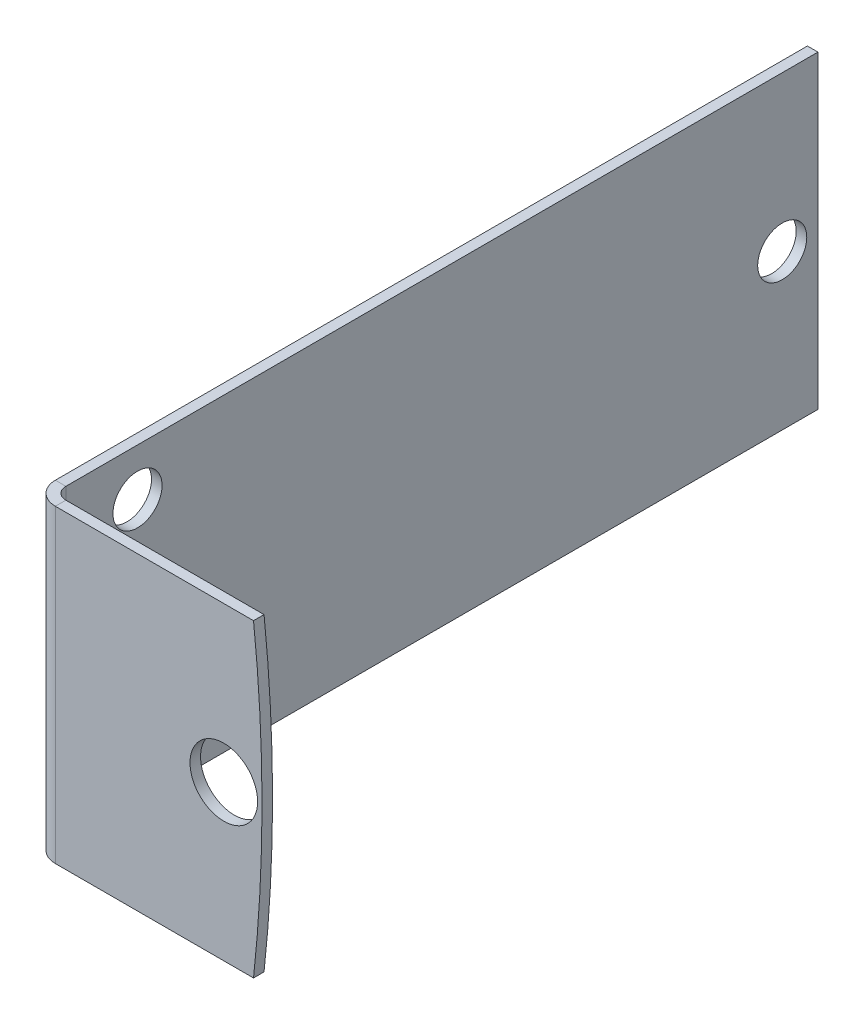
ISO-10303-21;
HEADER;
FILE_DESCRIPTION(('STEP AP214'),'2;1');
FILE_NAME('part.step','',(''),(''),'','','');
FILE_SCHEMA(('AUTOMOTIVE_DESIGN { 1 0 10303 214 1 1 1 1 }'));
ENDSEC;
DATA;
#1=APPLICATION_CONTEXT('core data for automotive mechanical design processes');
#2=APPLICATION_PROTOCOL_DEFINITION('international standard','automotive_design',2000,#1);
#3=PRODUCT_CONTEXT('',#1,'mechanical');
#4=PRODUCT('Part','Part','',(#3));
#5=PRODUCT_RELATED_PRODUCT_CATEGORY('part','',(#4));
#6=PRODUCT_DEFINITION_FORMATION('','',#4);
#7=PRODUCT_DEFINITION_CONTEXT('part definition',#1,'design');
#8=PRODUCT_DEFINITION('design','',#6,#7);
#9=PRODUCT_DEFINITION_SHAPE('','',#8);
#10=(LENGTH_UNIT() NAMED_UNIT(*) SI_UNIT(.MILLI.,.METRE.));
#11=(NAMED_UNIT(*) PLANE_ANGLE_UNIT() SI_UNIT($,.RADIAN.));
#12=(NAMED_UNIT(*) SI_UNIT($,.STERADIAN.) SOLID_ANGLE_UNIT());
#13=UNCERTAINTY_MEASURE_WITH_UNIT(LENGTH_MEASURE(1.E-05),#10,'distance_accuracy_value','');
#14=(GEOMETRIC_REPRESENTATION_CONTEXT(3) GLOBAL_UNCERTAINTY_ASSIGNED_CONTEXT((#13)) GLOBAL_UNIT_ASSIGNED_CONTEXT((#10,
#11,#12)) REPRESENTATION_CONTEXT('',''));
#15=CARTESIAN_POINT('',(0.,0.,0.));
#16=DIRECTION('',(0.,0.,1.));
#17=DIRECTION('',(1.,0.,0.));
#18=AXIS2_PLACEMENT_3D('',#15,#16,#17);
#19=CARTESIAN_POINT('',(-78.74,10.287,0.700000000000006));
#20=DIRECTION('',(0.,0.,-1.));
#21=DIRECTION('',(-1.,0.,0.));
#22=AXIS2_PLACEMENT_3D('',#19,#20,#21);
#23=PLANE('',#22);
#24=CARTESIAN_POINT('',(12.7,10.287,0.7000000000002));
#25=DIRECTION('',(0.,0.,1.));
#26=DIRECTION('',(1.,0.,0.));
#27=AXIS2_PLACEMENT_3D('',#24,#25,#26);
#28=CIRCLE('',#27,2.2479);
#29=CARTESIAN_POINT('',(14.9479,10.287,0.7000000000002));
#30=VERTEX_POINT('',#29);
#31=EDGE_CURVE('E183',#30,#30,#28,.T.);
#32=ORIENTED_EDGE('',*,*,#31,.F.);
#33=EDGE_LOOP('',(#32));
#34=FACE_BOUND('',#33,.T.);
#35=DIRECTION('',(0.,1.,0.));
#36=VECTOR('',#35,1.);
#37=CARTESIAN_POINT('',(1.5,20.574,0.700000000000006));
#38=LINE('',#37,#36);
#39=CARTESIAN_POINT('',(1.5,20.574,0.700000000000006));
#40=VERTEX_POINT('',#39);
#41=CARTESIAN_POINT('',(1.5,0.,0.700000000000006));
#42=VERTEX_POINT('',#41);
#43=EDGE_CURVE('E69',#40,#42,#38,.F.);
#44=ORIENTED_EDGE('',*,*,#43,.T.);
#45=DIRECTION('',(1.,0.,0.));
#46=VECTOR('',#45,1.);
#47=CARTESIAN_POINT('',(0.,0.,0.700000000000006));
#48=LINE('',#47,#46);
#49=CARTESIAN_POINT('',(14.6752986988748,0.,0.700000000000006));
#50=VERTEX_POINT('',#49);
#51=EDGE_CURVE('E189',#42,#50,#48,.T.);
#52=ORIENTED_EDGE('',*,*,#51,.T.);
#53=CARTESIAN_POINT('',(-78.74,10.287,0.700000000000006));
#54=DIRECTION('',(0.,0.,1.));
#55=DIRECTION('',(-1.,0.,0.));
#56=AXIS2_PLACEMENT_3D('',#53,#54,#55);
#57=CIRCLE('',#56,93.98);
#58=CARTESIAN_POINT('',(14.6752986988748,20.574,0.700000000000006));
#59=VERTEX_POINT('',#58);
#60=EDGE_CURVE('E191',#50,#59,#57,.T.);
#61=ORIENTED_EDGE('',*,*,#60,.T.);
#62=DIRECTION('',(-1.,0.,0.));
#63=VECTOR('',#62,1.);
#64=CARTESIAN_POINT('',(0.,20.574,0.700000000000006));
#65=LINE('',#64,#63);
#66=EDGE_CURVE('E194',#59,#40,#65,.T.);
#67=ORIENTED_EDGE('',*,*,#66,.T.);
#68=EDGE_LOOP('',(#44,#52,#61,#67));
#69=FACE_BOUND('',#68,.T.);
#70=ADVANCED_FACE('F52',(#34,#69),#23,.F.);
#71=CARTESIAN_POINT('',(-78.74,10.287,0.));
#72=DIRECTION('',(0.,0.,-1.));
#73=DIRECTION('',(-1.,0.,0.));
#74=AXIS2_PLACEMENT_3D('',#71,#72,#73);
#75=PLANE('',#74);
#76=CARTESIAN_POINT('',(12.7,10.287,2.22044604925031E-13));
#77=DIRECTION('',(0.,0.,1.));
#78=DIRECTION('',(1.,0.,0.));
#79=AXIS2_PLACEMENT_3D('',#76,#77,#78);
#80=CIRCLE('',#79,2.2479);
#81=CARTESIAN_POINT('',(14.9479,10.287,2.22044604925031E-13));
#82=VERTEX_POINT('',#81);
#83=EDGE_CURVE('E180',#82,#82,#80,.T.);
#84=ORIENTED_EDGE('',*,*,#83,.T.);
#85=EDGE_LOOP('',(#84));
#86=FACE_BOUND('',#85,.T.);
#87=DIRECTION('',(1.,0.,0.));
#88=VECTOR('',#87,1.);
#89=CARTESIAN_POINT('',(0.,0.,0.));
#90=LINE('',#89,#88);
#91=CARTESIAN_POINT('',(1.5,0.,0.));
#92=VERTEX_POINT('',#91);
#93=CARTESIAN_POINT('',(14.6752986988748,0.,0.));
#94=VERTEX_POINT('',#93);
#95=EDGE_CURVE('E186',#92,#94,#90,.T.);
#96=ORIENTED_EDGE('',*,*,#95,.F.);
#97=DIRECTION('',(0.,1.,0.));
#98=VECTOR('',#97,1.);
#99=CARTESIAN_POINT('',(1.5,20.574,0.));
#100=LINE('',#99,#98);
#101=CARTESIAN_POINT('',(1.5,20.574,0.));
#102=VERTEX_POINT('',#101);
#103=EDGE_CURVE('E173',#102,#92,#100,.F.);
#104=ORIENTED_EDGE('',*,*,#103,.F.);
#105=DIRECTION('',(-1.,0.,0.));
#106=VECTOR('',#105,1.);
#107=CARTESIAN_POINT('',(0.,20.574,0.));
#108=LINE('',#107,#106);
#109=CARTESIAN_POINT('',(14.6752986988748,20.574,0.));
#110=VERTEX_POINT('',#109);
#111=EDGE_CURVE('E192',#110,#102,#108,.T.);
#112=ORIENTED_EDGE('',*,*,#111,.F.);
#113=CARTESIAN_POINT('',(-78.74,10.287,0.));
#114=DIRECTION('',(0.,0.,1.));
#115=DIRECTION('',(-1.,0.,0.));
#116=AXIS2_PLACEMENT_3D('',#113,#114,#115);
#117=CIRCLE('',#116,93.98);
#118=EDGE_CURVE('E197',#94,#110,#117,.T.);
#119=ORIENTED_EDGE('',*,*,#118,.F.);
#120=EDGE_LOOP('',(#96,#104,#112,#119));
#121=FACE_BOUND('',#120,.T.);
#122=ADVANCED_FACE('F257',(#86,#121),#75,.T.);
#123=CARTESIAN_POINT('',(0.,0.,0.700000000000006));
#124=DIRECTION('',(0.,1.,0.));
#125=DIRECTION('',(0.,0.,1.));
#126=AXIS2_PLACEMENT_3D('',#123,#124,#125);
#127=PLANE('',#126);
#128=DIRECTION('',(0.,0.,1.));
#129=VECTOR('',#128,1.);
#130=CARTESIAN_POINT('',(1.5,0.,0.));
#131=LINE('',#130,#129);
#132=EDGE_CURVE('E76',#92,#42,#131,.T.);
#133=ORIENTED_EDGE('',*,*,#132,.F.);
#134=ORIENTED_EDGE('',*,*,#95,.T.);
#135=DIRECTION('',(0.,0.,-1.));
#136=VECTOR('',#135,1.);
#137=CARTESIAN_POINT('',(14.6752986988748,0.,0.700000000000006));
#138=LINE('',#137,#136);
#139=EDGE_CURVE('E13',#50,#94,#138,.T.);
#140=ORIENTED_EDGE('',*,*,#139,.F.);
#141=ORIENTED_EDGE('',*,*,#51,.F.);
#142=EDGE_LOOP('',(#133,#134,#140,#141));
#143=FACE_BOUND('',#142,.T.);
#144=ADVANCED_FACE('F54',(#143),#127,.F.);
#145=CARTESIAN_POINT('',(0.,20.574,0.700000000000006));
#146=DIRECTION('',(0.,-1.,0.));
#147=DIRECTION('',(1.,0.,0.));
#148=AXIS2_PLACEMENT_3D('',#145,#146,#147);
#149=PLANE('',#148);
#150=DIRECTION('',(0.,0.,1.));
#151=VECTOR('',#150,1.);
#152=CARTESIAN_POINT('',(1.5,20.574,0.));
#153=LINE('',#152,#151);
#154=EDGE_CURVE('E167',#102,#40,#153,.T.);
#155=ORIENTED_EDGE('',*,*,#154,.T.);
#156=ORIENTED_EDGE('',*,*,#66,.F.);
#157=DIRECTION('',(0.,0.,-1.));
#158=VECTOR('',#157,1.);
#159=CARTESIAN_POINT('',(14.6752986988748,20.574,0.700000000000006));
#160=LINE('',#159,#158);
#161=EDGE_CURVE('E61',#59,#110,#160,.T.);
#162=ORIENTED_EDGE('',*,*,#161,.T.);
#163=ORIENTED_EDGE('',*,*,#111,.T.);
#164=EDGE_LOOP('',(#155,#156,#162,#163));
#165=FACE_BOUND('',#164,.T.);
#166=ADVANCED_FACE('F234',(#165),#149,.F.);
#167=CARTESIAN_POINT('',(-78.74,10.287,0.700000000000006));
#168=DIRECTION('',(0.,0.,-1.));
#169=DIRECTION('',(-1.,0.,0.));
#170=AXIS2_PLACEMENT_3D('',#167,#168,#169);
#171=CYLINDRICAL_SURFACE('',#170,93.98);
#172=ORIENTED_EDGE('',*,*,#118,.T.);
#173=ORIENTED_EDGE('',*,*,#161,.F.);
#174=ORIENTED_EDGE('',*,*,#60,.F.);
#175=ORIENTED_EDGE('',*,*,#139,.T.);
#176=EDGE_LOOP('',(#172,#173,#174,#175));
#177=FACE_BOUND('',#176,.T.);
#178=ADVANCED_FACE('F250',(#177),#171,.T.);
#179=CARTESIAN_POINT('',(12.7,10.287,0.7000000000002));
#180=DIRECTION('',(0.,0.,-1.));
#181=DIRECTION('',(-1.,0.,0.));
#182=AXIS2_PLACEMENT_3D('',#179,#180,#181);
#183=CYLINDRICAL_SURFACE('',#182,2.2479);
#184=ORIENTED_EDGE('',*,*,#31,.T.);
#185=EDGE_LOOP('',(#184));
#186=FACE_BOUND('',#185,.T.);
#187=ORIENTED_EDGE('',*,*,#83,.F.);
#188=EDGE_LOOP('',(#187));
#189=FACE_BOUND('',#188,.T.);
#190=ADVANCED_FACE('F243',(#186,#189),#183,.F.);
#191=CARTESIAN_POINT('',(1.5,0.,-0.799999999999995));
#192=DIRECTION('',(0.,-1.,0.));
#193=DIRECTION('',(1.,0.,0.));
#194=AXIS2_PLACEMENT_3D('',#191,#192,#193);
#195=PLANE('',#194);
#196=DIRECTION('',(1.,0.,0.));
#197=VECTOR('',#196,1.);
#198=CARTESIAN_POINT('',(0.,0.,-0.799999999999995));
#199=LINE('',#198,#197);
#200=CARTESIAN_POINT('',(0.699999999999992,0.,-0.799999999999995));
#201=VERTEX_POINT('',#200);
#202=CARTESIAN_POINT('',(0.,0.,-0.799999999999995));
#203=VERTEX_POINT('',#202);
#204=EDGE_CURVE('E143',#201,#203,#199,.F.);
#205=ORIENTED_EDGE('',*,*,#204,.F.);
#206=CARTESIAN_POINT('',(1.5,0.,-0.799999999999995));
#207=DIRECTION('',(0.,1.,0.));
#208=DIRECTION('',(-1.,0.,0.));
#209=AXIS2_PLACEMENT_3D('',#206,#207,#208);
#210=CIRCLE('',#209,0.800000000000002);
#211=EDGE_CURVE('E170',#92,#201,#210,.F.);
#212=ORIENTED_EDGE('',*,*,#211,.F.);
#213=ORIENTED_EDGE('',*,*,#132,.T.);
#214=CARTESIAN_POINT('',(1.5,0.,-0.799999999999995));
#215=DIRECTION('',(0.,1.,0.));
#216=DIRECTION('',(-1.,0.,0.));
#217=AXIS2_PLACEMENT_3D('',#214,#215,#216);
#218=CIRCLE('',#217,1.5);
#219=EDGE_CURVE('E163',#42,#203,#218,.F.);
#220=ORIENTED_EDGE('',*,*,#219,.T.);
#221=EDGE_LOOP('',(#205,#212,#213,#220));
#222=FACE_BOUND('',#221,.T.);
#223=ADVANCED_FACE('F241',(#222),#195,.T.);
#224=CARTESIAN_POINT('',(1.49999999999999,20.574,-0.799999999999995));
#225=DIRECTION('',(0.,-1.,0.));
#226=DIRECTION('',(1.,0.,0.));
#227=AXIS2_PLACEMENT_3D('',#224,#225,#226);
#228=PLANE('',#227);
#229=CARTESIAN_POINT('',(1.49999999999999,20.574,-0.799999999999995));
#230=DIRECTION('',(0.,1.,0.));
#231=DIRECTION('',(-1.,0.,0.));
#232=AXIS2_PLACEMENT_3D('',#229,#230,#231);
#233=CIRCLE('',#232,0.800000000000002);
#234=CARTESIAN_POINT('',(0.699999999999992,20.574,-0.799999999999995));
#235=VERTEX_POINT('',#234);
#236=EDGE_CURVE('E176',#235,#102,#233,.T.);
#237=ORIENTED_EDGE('',*,*,#236,.F.);
#238=DIRECTION('',(1.,0.,0.));
#239=VECTOR('',#238,1.);
#240=CARTESIAN_POINT('',(0.699999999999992,20.574,-0.799999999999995));
#241=LINE('',#240,#239);
#242=CARTESIAN_POINT('',(0.,20.574,-0.799999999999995));
#243=VERTEX_POINT('',#242);
#244=EDGE_CURVE('E155',#235,#243,#241,.F.);
#245=ORIENTED_EDGE('',*,*,#244,.T.);
#246=CARTESIAN_POINT('',(1.49999999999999,20.574,-0.799999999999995));
#247=DIRECTION('',(0.,1.,0.));
#248=DIRECTION('',(-1.,0.,0.));
#249=AXIS2_PLACEMENT_3D('',#246,#247,#248);
#250=CIRCLE('',#249,1.5);
#251=EDGE_CURVE('E164',#243,#40,#250,.T.);
#252=ORIENTED_EDGE('',*,*,#251,.T.);
#253=ORIENTED_EDGE('',*,*,#154,.F.);
#254=EDGE_LOOP('',(#237,#245,#252,#253));
#255=FACE_BOUND('',#254,.T.);
#256=ADVANCED_FACE('F231',(#255),#228,.F.);
#257=CARTESIAN_POINT('',(1.49999999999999,20.574,-0.799999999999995));
#258=DIRECTION('',(0.,1.,0.));
#259=DIRECTION('',(-1.,0.,0.));
#260=AXIS2_PLACEMENT_3D('',#257,#258,#259);
#261=CYLINDRICAL_SURFACE('',#260,1.5);
#262=ORIENTED_EDGE('',*,*,#43,.F.);
#263=ORIENTED_EDGE('',*,*,#251,.F.);
#264=DIRECTION('',(0.,1.,0.));
#265=VECTOR('',#264,1.);
#266=CARTESIAN_POINT('',(0.,0.,-0.799999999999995));
#267=LINE('',#266,#265);
#268=EDGE_CURVE('E153',#243,#203,#267,.F.);
#269=ORIENTED_EDGE('',*,*,#268,.T.);
#270=ORIENTED_EDGE('',*,*,#219,.F.);
#271=EDGE_LOOP('',(#262,#263,#269,#270));
#272=FACE_BOUND('',#271,.T.);
#273=ADVANCED_FACE('F239',(#272),#261,.T.);
#274=CARTESIAN_POINT('',(1.49999999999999,20.574,-0.799999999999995));
#275=DIRECTION('',(0.,1.,0.));
#276=DIRECTION('',(-1.,0.,0.));
#277=AXIS2_PLACEMENT_3D('',#274,#275,#276);
#278=CYLINDRICAL_SURFACE('',#277,0.800000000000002);
#279=ORIENTED_EDGE('',*,*,#103,.T.);
#280=ORIENTED_EDGE('',*,*,#211,.T.);
#281=DIRECTION('',(0.,1.,0.));
#282=VECTOR('',#281,1.);
#283=CARTESIAN_POINT('',(0.699999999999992,0.,-0.799999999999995));
#284=LINE('',#283,#282);
#285=EDGE_CURVE('E158',#201,#235,#284,.T.);
#286=ORIENTED_EDGE('',*,*,#285,.T.);
#287=ORIENTED_EDGE('',*,*,#236,.T.);
#288=EDGE_LOOP('',(#279,#280,#286,#287));
#289=FACE_BOUND('',#288,.T.);
#290=ADVANCED_FACE('F227',(#289),#278,.F.);
#291=CARTESIAN_POINT('',(-1.80411241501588E-13,20.574,-50.8));
#292=DIRECTION('',(0.,-1.,0.));
#293=DIRECTION('',(1.,0.,0.));
#294=AXIS2_PLACEMENT_3D('',#291,#292,#293);
#295=PLANE('',#294);
#296=ORIENTED_EDGE('',*,*,#244,.F.);
#297=DIRECTION('',(0.,0.,1.));
#298=VECTOR('',#297,1.);
#299=CARTESIAN_POINT('',(0.699999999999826,20.574,-50.8));
#300=LINE('',#299,#298);
#301=CARTESIAN_POINT('',(0.699999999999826,20.574,-50.8));
#302=VERTEX_POINT('',#301);
#303=EDGE_CURVE('E151',#235,#302,#300,.F.);
#304=ORIENTED_EDGE('',*,*,#303,.T.);
#305=DIRECTION('',(1.,0.,0.));
#306=VECTOR('',#305,1.);
#307=CARTESIAN_POINT('',(-1.80411241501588E-13,20.574,-50.8));
#308=LINE('',#307,#306);
#309=CARTESIAN_POINT('',(-1.80411241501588E-13,20.574,-50.8));
#310=VERTEX_POINT('',#309);
#311=EDGE_CURVE('E139',#310,#302,#308,.T.);
#312=ORIENTED_EDGE('',*,*,#311,.F.);
#313=DIRECTION('',(0.,0.,-1.));
#314=VECTOR('',#313,1.);
#315=CARTESIAN_POINT('',(0.,20.574,0.));
#316=LINE('',#315,#314);
#317=EDGE_CURVE('E126',#243,#310,#316,.T.);
#318=ORIENTED_EDGE('',*,*,#317,.F.);
#319=EDGE_LOOP('',(#296,#304,#312,#318));
#320=FACE_BOUND('',#319,.T.);
#321=ADVANCED_FACE('F220',(#320),#295,.F.);
#322=CARTESIAN_POINT('',(0.,0.,0.));
#323=DIRECTION('',(0.,1.,0.));
#324=DIRECTION('',(-1.,0.,0.));
#325=AXIS2_PLACEMENT_3D('',#322,#323,#324);
#326=PLANE('',#325);
#327=ORIENTED_EDGE('',*,*,#204,.T.);
#328=DIRECTION('',(0.,0.,1.));
#329=VECTOR('',#328,1.);
#330=CARTESIAN_POINT('',(0.,0.,0.));
#331=LINE('',#330,#329);
#332=CARTESIAN_POINT('',(-1.80411241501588E-13,0.,-50.8));
#333=VERTEX_POINT('',#332);
#334=EDGE_CURVE('E124',#333,#203,#331,.T.);
#335=ORIENTED_EDGE('',*,*,#334,.F.);
#336=DIRECTION('',(1.,0.,0.));
#337=VECTOR('',#336,1.);
#338=CARTESIAN_POINT('',(-1.80411241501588E-13,0.,-50.8));
#339=LINE('',#338,#337);
#340=CARTESIAN_POINT('',(0.699999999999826,0.,-50.8));
#341=VERTEX_POINT('',#340);
#342=EDGE_CURVE('E132',#333,#341,#339,.T.);
#343=ORIENTED_EDGE('',*,*,#342,.T.);
#344=DIRECTION('',(0.,0.,-1.));
#345=VECTOR('',#344,1.);
#346=CARTESIAN_POINT('',(0.700000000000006,0.,0.));
#347=LINE('',#346,#345);
#348=EDGE_CURVE('E148',#341,#201,#347,.F.);
#349=ORIENTED_EDGE('',*,*,#348,.T.);
#350=EDGE_LOOP('',(#327,#335,#343,#349));
#351=FACE_BOUND('',#350,.T.);
#352=ADVANCED_FACE('F142',(#351),#326,.F.);
#353=CARTESIAN_POINT('',(0.,20.574,0.));
#354=DIRECTION('',(1.,0.,0.));
#355=DIRECTION('',(0.,0.,-1.));
#356=AXIS2_PLACEMENT_3D('',#353,#354,#355);
#357=PLANE('',#356);
#358=CARTESIAN_POINT('',(-1.66533453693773E-13,10.287,-48.425));
#359=DIRECTION('',(-1.,0.,0.));
#360=DIRECTION('',(0.,0.,1.));
#361=AXIS2_PLACEMENT_3D('',#358,#359,#360);
#362=CIRCLE('',#361,1.63194999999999);
#363=CARTESIAN_POINT('',(-1.60835527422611E-13,10.287,-46.79305));
#364=VERTEX_POINT('',#363);
#365=EDGE_CURVE('E216',#364,#364,#362,.T.);
#366=ORIENTED_EDGE('',*,*,#365,.F.);
#367=EDGE_LOOP('',(#366));
#368=FACE_BOUND('',#367,.T.);
#369=CARTESIAN_POINT('',(-1.38777878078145E-13,17.43075,-5.5625));
#370=DIRECTION('',(-1.,0.,0.));
#371=DIRECTION('',(0.,0.,1.));
#372=AXIS2_PLACEMENT_3D('',#369,#370,#371);
#373=CIRCLE('',#372,1.63194999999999);
#374=CARTESIAN_POINT('',(-1.33079951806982E-13,17.43075,-3.93055000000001));
#375=VERTEX_POINT('',#374);
#376=EDGE_CURVE('E206',#375,#375,#373,.T.);
#377=ORIENTED_EDGE('',*,*,#376,.F.);
#378=EDGE_LOOP('',(#377));
#379=FACE_BOUND('',#378,.T.);
#380=CARTESIAN_POINT('',(-1.38777878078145E-13,3.14325,-5.5625));
#381=DIRECTION('',(-1.,0.,0.));
#382=DIRECTION('',(0.,0.,1.));
#383=AXIS2_PLACEMENT_3D('',#380,#381,#382);
#384=CIRCLE('',#383,1.63194999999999);
#385=CARTESIAN_POINT('',(-1.33079951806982E-13,3.14325,-3.93055000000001));
#386=VERTEX_POINT('',#385);
#387=EDGE_CURVE('E203',#386,#386,#384,.T.);
#388=ORIENTED_EDGE('',*,*,#387,.F.);
#389=EDGE_LOOP('',(#388));
#390=FACE_BOUND('',#389,.T.);
#391=ORIENTED_EDGE('',*,*,#268,.F.);
#392=ORIENTED_EDGE('',*,*,#317,.T.);
#393=DIRECTION('',(0.,-1.,0.));
#394=VECTOR('',#393,1.);
#395=CARTESIAN_POINT('',(-1.80411241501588E-13,20.574,-50.8));
#396=LINE('',#395,#394);
#397=EDGE_CURVE('E119',#310,#333,#396,.T.);
#398=ORIENTED_EDGE('',*,*,#397,.T.);
#399=ORIENTED_EDGE('',*,*,#334,.T.);
#400=EDGE_LOOP('',(#391,#392,#398,#399));
#401=FACE_BOUND('',#400,.T.);
#402=ADVANCED_FACE('F122',(#368,#379,#390,#401),#357,.F.);
#403=CARTESIAN_POINT('',(0.699999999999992,20.574,0.));
#404=DIRECTION('',(1.,0.,0.));
#405=DIRECTION('',(0.,0.,-1.));
#406=AXIS2_PLACEMENT_3D('',#403,#404,#405);
#407=PLANE('',#406);
#408=CARTESIAN_POINT('',(0.699999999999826,10.287,-48.425));
#409=DIRECTION('',(1.,0.,0.));
#410=DIRECTION('',(0.,0.,-1.));
#411=AXIS2_PLACEMENT_3D('',#408,#409,#410);
#412=CIRCLE('',#411,1.63194999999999);
#413=CARTESIAN_POINT('',(0.69999999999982,10.287,-50.05695));
#414=VERTEX_POINT('',#413);
#415=EDGE_CURVE('E56',#414,#414,#412,.T.);
#416=ORIENTED_EDGE('',*,*,#415,.F.);
#417=EDGE_LOOP('',(#416));
#418=FACE_BOUND('',#417,.T.);
#419=CARTESIAN_POINT('',(0.699999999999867,17.43075,-5.5625));
#420=DIRECTION('',(1.,0.,0.));
#421=DIRECTION('',(0.,0.,-1.));
#422=AXIS2_PLACEMENT_3D('',#419,#420,#421);
#423=CIRCLE('',#422,1.63194999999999);
#424=CARTESIAN_POINT('',(0.699999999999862,17.43075,-7.19444999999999));
#425=VERTEX_POINT('',#424);
#426=EDGE_CURVE('E204',#425,#425,#423,.T.);
#427=ORIENTED_EDGE('',*,*,#426,.F.);
#428=EDGE_LOOP('',(#427));
#429=FACE_BOUND('',#428,.T.);
#430=CARTESIAN_POINT('',(0.699999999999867,3.14325,-5.5625));
#431=DIRECTION('',(1.,0.,0.));
#432=DIRECTION('',(0.,0.,-1.));
#433=AXIS2_PLACEMENT_3D('',#430,#431,#432);
#434=CIRCLE('',#433,1.63194999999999);
#435=CARTESIAN_POINT('',(0.699999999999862,3.14325,-7.19444999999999));
#436=VERTEX_POINT('',#435);
#437=EDGE_CURVE('E161',#436,#436,#434,.T.);
#438=ORIENTED_EDGE('',*,*,#437,.F.);
#439=EDGE_LOOP('',(#438));
#440=FACE_BOUND('',#439,.T.);
#441=ORIENTED_EDGE('',*,*,#303,.F.);
#442=ORIENTED_EDGE('',*,*,#285,.F.);
#443=ORIENTED_EDGE('',*,*,#348,.F.);
#444=DIRECTION('',(0.,1.,0.));
#445=VECTOR('',#444,1.);
#446=CARTESIAN_POINT('',(0.699999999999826,0.,-50.8));
#447=LINE('',#446,#445);
#448=EDGE_CURVE('E135',#302,#341,#447,.F.);
#449=ORIENTED_EDGE('',*,*,#448,.F.);
#450=EDGE_LOOP('',(#441,#442,#443,#449));
#451=FACE_BOUND('',#450,.T.);
#452=ADVANCED_FACE('F224',(#418,#429,#440,#451),#407,.T.);
#453=CARTESIAN_POINT('',(-1.80411241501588E-13,0.,-50.8));
#454=DIRECTION('',(0.,0.,1.));
#455=DIRECTION('',(1.,0.,0.));
#456=AXIS2_PLACEMENT_3D('',#453,#454,#455);
#457=PLANE('',#456);
#458=ORIENTED_EDGE('',*,*,#448,.T.);
#459=ORIENTED_EDGE('',*,*,#342,.F.);
#460=ORIENTED_EDGE('',*,*,#397,.F.);
#461=ORIENTED_EDGE('',*,*,#311,.T.);
#462=EDGE_LOOP('',(#458,#459,#460,#461));
#463=FACE_BOUND('',#462,.T.);
#464=ADVANCED_FACE('F133',(#463),#457,.F.);
#465=CARTESIAN_POINT('',(-1.2490009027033E-13,3.14325,-5.5625));
#466=DIRECTION('',(-1.,0.,0.));
#467=DIRECTION('',(0.,0.,1.));
#468=AXIS2_PLACEMENT_3D('',#465,#466,#467);
#469=CYLINDRICAL_SURFACE('',#468,1.63194999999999);
#470=ORIENTED_EDGE('',*,*,#437,.T.);
#471=EDGE_LOOP('',(#470));
#472=FACE_BOUND('',#471,.T.);
#473=ORIENTED_EDGE('',*,*,#387,.T.);
#474=EDGE_LOOP('',(#473));
#475=FACE_BOUND('',#474,.T.);
#476=ADVANCED_FACE('F373',(#472,#475),#469,.F.);
#477=CARTESIAN_POINT('',(-1.38777878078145E-13,17.43075,-5.5625));
#478=DIRECTION('',(-1.,0.,0.));
#479=DIRECTION('',(0.,0.,1.));
#480=AXIS2_PLACEMENT_3D('',#477,#478,#479);
#481=CYLINDRICAL_SURFACE('',#480,1.63194999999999);
#482=ORIENTED_EDGE('',*,*,#426,.T.);
#483=EDGE_LOOP('',(#482));
#484=FACE_BOUND('',#483,.T.);
#485=ORIENTED_EDGE('',*,*,#376,.T.);
#486=EDGE_LOOP('',(#485));
#487=FACE_BOUND('',#486,.T.);
#488=ADVANCED_FACE('F381',(#484,#487),#481,.F.);
#489=CARTESIAN_POINT('',(-1.66533453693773E-13,10.287,-48.425));
#490=DIRECTION('',(-1.,0.,0.));
#491=DIRECTION('',(0.,0.,1.));
#492=AXIS2_PLACEMENT_3D('',#489,#490,#491);
#493=CYLINDRICAL_SURFACE('',#492,1.63194999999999);
#494=ORIENTED_EDGE('',*,*,#415,.T.);
#495=EDGE_LOOP('',(#494));
#496=FACE_BOUND('',#495,.T.);
#497=ORIENTED_EDGE('',*,*,#365,.T.);
#498=EDGE_LOOP('',(#497));
#499=FACE_BOUND('',#498,.T.);
#500=ADVANCED_FACE('F389',(#496,#499),#493,.F.);
#501=CLOSED_SHELL('',(#70,#122,#144,#166,#178,#190,#223,#256,#273,#290,#321,#352,#402,#452,#464,
#476,#488,#500));
#502=MANIFOLD_SOLID_BREP('B2',#501);
#503=ADVANCED_BREP_SHAPE_REPRESENTATION('',(#18,#502),#14);
#504=SHAPE_DEFINITION_REPRESENTATION(#9,#503);
ENDSEC;
END-ISO-10303-21;
